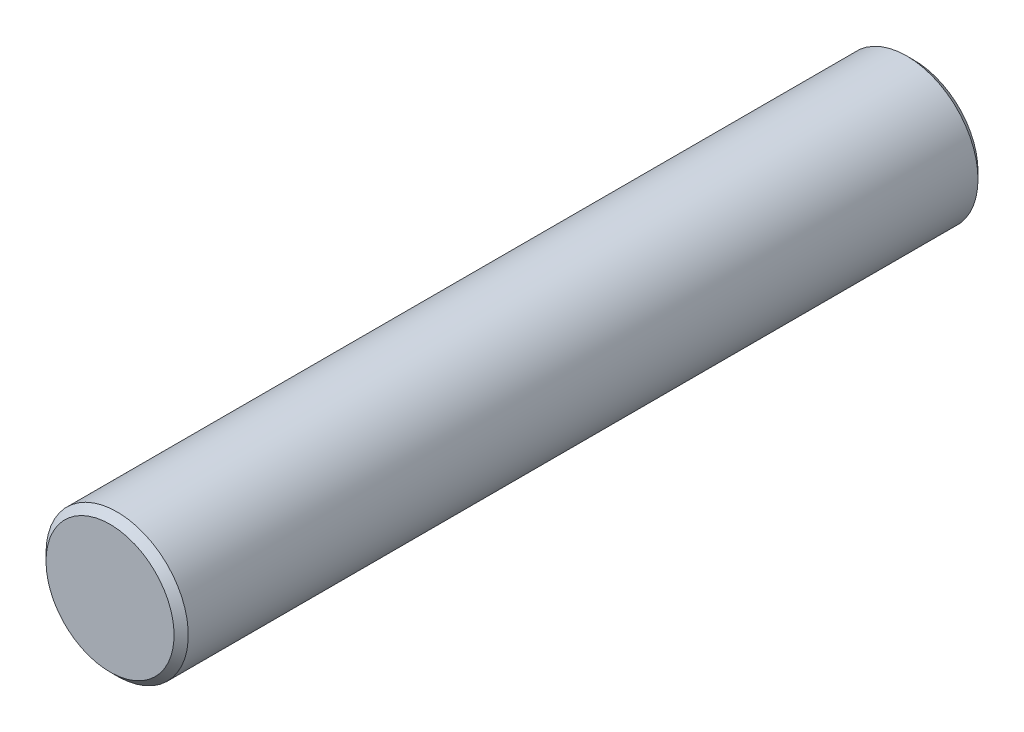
ISO-10303-21;
HEADER;
FILE_DESCRIPTION(('STEP AP214'),'2;1');
FILE_NAME('part.step','',(''),(''),'','','');
FILE_SCHEMA(('AUTOMOTIVE_DESIGN { 1 0 10303 214 1 1 1 1 }'));
ENDSEC;
DATA;
#1=APPLICATION_CONTEXT('core data for automotive mechanical design processes');
#2=APPLICATION_PROTOCOL_DEFINITION('international standard','automotive_design',2000,#1);
#3=PRODUCT_CONTEXT('',#1,'mechanical');
#4=PRODUCT('Part','Part','',(#3));
#5=PRODUCT_RELATED_PRODUCT_CATEGORY('part','',(#4));
#6=PRODUCT_DEFINITION_FORMATION('','',#4);
#7=PRODUCT_DEFINITION_CONTEXT('part definition',#1,'design');
#8=PRODUCT_DEFINITION('design','',#6,#7);
#9=PRODUCT_DEFINITION_SHAPE('','',#8);
#10=(LENGTH_UNIT() NAMED_UNIT(*) SI_UNIT(.MILLI.,.METRE.));
#11=(NAMED_UNIT(*) PLANE_ANGLE_UNIT() SI_UNIT($,.RADIAN.));
#12=(NAMED_UNIT(*) SI_UNIT($,.STERADIAN.) SOLID_ANGLE_UNIT());
#13=UNCERTAINTY_MEASURE_WITH_UNIT(LENGTH_MEASURE(1.E-05),#10,'distance_accuracy_value','');
#14=(GEOMETRIC_REPRESENTATION_CONTEXT(3) GLOBAL_UNCERTAINTY_ASSIGNED_CONTEXT((#13)) GLOBAL_UNIT_ASSIGNED_CONTEXT((#10,
#11,#12)) REPRESENTATION_CONTEXT('',''));
#15=CARTESIAN_POINT('',(0.,0.,0.));
#16=DIRECTION('',(0.,0.,1.));
#17=DIRECTION('',(1.,0.,0.));
#18=AXIS2_PLACEMENT_3D('',#15,#16,#17);
#19=CARTESIAN_POINT('',(0.,-1.66533453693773E-13,113.));
#20=DIRECTION('',(0.,0.,-0.999999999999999));
#21=DIRECTION('',(-0.999999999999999,0.,0.));
#22=AXIS2_PLACEMENT_3D('',#19,#20,#21);
#23=CYLINDRICAL_SURFACE('',#22,10.);
#24=CARTESIAN_POINT('',(0.,0.,1.));
#25=DIRECTION('',(0.,0.,0.999999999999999));
#26=DIRECTION('',(0.999999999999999,0.,0.));
#27=AXIS2_PLACEMENT_3D('',#24,#25,#26);
#28=CIRCLE('',#27,10.);
#29=CARTESIAN_POINT('',(-10.,-1.65423230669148E-13,0.999999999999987));
#30=VERTEX_POINT('',#29);
#31=EDGE_CURVE('E42',#30,#30,#28,.T.);
#32=CARTESIAN_POINT('',(0.,-1.66533453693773E-13,112.));
#33=DIRECTION('',(0.,0.,0.999999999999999));
#34=DIRECTION('',(0.999999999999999,0.,0.));
#35=AXIS2_PLACEMENT_3D('',#32,#33,#34);
#36=CIRCLE('',#35,10.);
#37=CARTESIAN_POINT('',(-10.,-1.65423230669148E-13,112.));
#38=VERTEX_POINT('',#37);
#39=EDGE_CURVE('E46',#38,#38,#36,.F.);
#40=CARTESIAN_POINT('',(-10.,-1.65423230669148E-13,0.999999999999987));
#41=CARTESIAN_POINT('',(-10.,-1.65423230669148E-13,2.15624999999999));
#42=CARTESIAN_POINT('',(-10.,-1.65423230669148E-13,3.31249999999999));
#43=CARTESIAN_POINT('',(-10.,-1.65423230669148E-13,5.62499999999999));
#44=CARTESIAN_POINT('',(-10.,-1.65423230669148E-13,6.78124999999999));
#45=CARTESIAN_POINT('',(-10.,-1.65423230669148E-13,9.09374999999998));
#46=CARTESIAN_POINT('',(-10.,-1.65423230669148E-13,10.25));
#47=CARTESIAN_POINT('',(-10.,-1.65423230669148E-13,12.5625));
#48=CARTESIAN_POINT('',(-10.,-1.65423230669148E-13,13.71875));
#49=CARTESIAN_POINT('',(-10.,-1.65423230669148E-13,16.03125));
#50=CARTESIAN_POINT('',(-10.,-1.65423230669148E-13,17.1875));
#51=CARTESIAN_POINT('',(-10.,-1.65423230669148E-13,19.5));
#52=CARTESIAN_POINT('',(-10.,-1.65423230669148E-13,20.65625));
#53=CARTESIAN_POINT('',(-10.,-1.65423230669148E-13,22.96875));
#54=CARTESIAN_POINT('',(-10.,-1.65423230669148E-13,24.125));
#55=CARTESIAN_POINT('',(-10.,-1.65423230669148E-13,26.4375));
#56=CARTESIAN_POINT('',(-10.,-1.65423230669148E-13,27.59375));
#57=CARTESIAN_POINT('',(-10.,-1.65423230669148E-13,29.90625));
#58=CARTESIAN_POINT('',(-10.,-1.65423230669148E-13,31.0625));
#59=CARTESIAN_POINT('',(-10.,-1.65423230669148E-13,33.375));
#60=CARTESIAN_POINT('',(-10.,-1.65423230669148E-13,34.53125));
#61=CARTESIAN_POINT('',(-10.,-1.65423230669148E-13,36.84375));
#62=CARTESIAN_POINT('',(-10.,-1.65423230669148E-13,38.));
#63=CARTESIAN_POINT('',(-10.,-1.65423230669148E-13,40.3125));
#64=CARTESIAN_POINT('',(-10.,-1.65423230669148E-13,41.46875));
#65=CARTESIAN_POINT('',(-10.,-1.65423230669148E-13,43.78125));
#66=CARTESIAN_POINT('',(-10.,-1.65423230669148E-13,44.9375));
#67=CARTESIAN_POINT('',(-10.,-1.65423230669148E-13,47.25));
#68=CARTESIAN_POINT('',(-10.,-1.65423230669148E-13,48.40625));
#69=CARTESIAN_POINT('',(-10.,-1.65423230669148E-13,50.71875));
#70=CARTESIAN_POINT('',(-10.,-1.65423230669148E-13,51.875));
#71=CARTESIAN_POINT('',(-10.,-1.65423230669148E-13,54.1875));
#72=CARTESIAN_POINT('',(-10.,-1.65423230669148E-13,55.34375));
#73=CARTESIAN_POINT('',(-10.,-1.65423230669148E-13,57.65625));
#74=CARTESIAN_POINT('',(-10.,-1.65423230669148E-13,58.8125));
#75=CARTESIAN_POINT('',(-10.,-1.65423230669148E-13,61.125));
#76=CARTESIAN_POINT('',(-10.,-1.65423230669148E-13,62.28125));
#77=CARTESIAN_POINT('',(-10.,-1.65423230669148E-13,64.59375));
#78=CARTESIAN_POINT('',(-10.,-1.65423230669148E-13,65.75));
#79=CARTESIAN_POINT('',(-10.,-1.65423230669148E-13,68.0625));
#80=CARTESIAN_POINT('',(-10.,-1.65423230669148E-13,69.21875));
#81=CARTESIAN_POINT('',(-10.,-1.65423230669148E-13,71.53125));
#82=CARTESIAN_POINT('',(-10.,-1.65423230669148E-13,72.6875));
#83=CARTESIAN_POINT('',(-10.,-1.65423230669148E-13,75.));
#84=CARTESIAN_POINT('',(-10.,-1.65423230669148E-13,76.15625));
#85=CARTESIAN_POINT('',(-10.,-1.65423230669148E-13,78.46875));
#86=CARTESIAN_POINT('',(-10.,-1.65423230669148E-13,79.625));
#87=CARTESIAN_POINT('',(-10.,-1.65423230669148E-13,81.9375));
#88=CARTESIAN_POINT('',(-10.,-1.65423230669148E-13,83.09375));
#89=CARTESIAN_POINT('',(-10.,-1.65423230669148E-13,85.40625));
#90=CARTESIAN_POINT('',(-10.,-1.65423230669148E-13,86.5625));
#91=CARTESIAN_POINT('',(-10.,-1.65423230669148E-13,88.875));
#92=CARTESIAN_POINT('',(-10.,-1.65423230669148E-13,90.03125));
#93=CARTESIAN_POINT('',(-10.,-1.65423230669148E-13,92.34375));
#94=CARTESIAN_POINT('',(-10.,-1.65423230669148E-13,93.5));
#95=CARTESIAN_POINT('',(-10.,-1.65423230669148E-13,95.8125));
#96=CARTESIAN_POINT('',(-10.,-1.65423230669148E-13,96.96875));
#97=CARTESIAN_POINT('',(-10.,-1.65423230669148E-13,99.28125));
#98=CARTESIAN_POINT('',(-10.,-1.65423230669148E-13,100.4375));
#99=CARTESIAN_POINT('',(-10.,-1.65423230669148E-13,102.75));
#100=CARTESIAN_POINT('',(-10.,-1.65423230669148E-13,103.90625));
#101=CARTESIAN_POINT('',(-10.,-1.65423230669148E-13,106.21875));
#102=CARTESIAN_POINT('',(-10.,-1.65423230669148E-13,107.375));
#103=CARTESIAN_POINT('',(-10.,-1.65423230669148E-13,109.6875));
#104=CARTESIAN_POINT('',(-10.,-1.65423230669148E-13,110.84375));
#105=CARTESIAN_POINT('',(-10.,-1.65423230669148E-13,112.));
#106=B_SPLINE_CURVE_WITH_KNOTS('',3,(#40,#41,#42,#43,#44,#45,#46,#47,#48,#49,#50,#51,#52,#53,
#54,#55,#56,#57,#58,#59,#60,#61,#62,#63,#64,#65,#66,#67,#68,#69,#70,#71,#72,#73,#74,#75,#76,#77,
#78,#79,#80,#81,#82,#83,#84,#85,#86,#87,#88,#89,#90,#91,#92,#93,#94,#95,#96,#97,#98,#99,#100,
#101,#102,#103,#104,#105),.UNSPECIFIED.,.F.,.F.,(4,2,2,2,2,2,2,2,2,2,2,2,2,2,2,2,2,2,2,2,2,2,2,
2,2,2,2,2,2,2,2,2,4),(0.,3.46875000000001,6.9375,10.40625,13.875,17.34375,20.8125,24.28125,
27.75,31.21875,34.6875,38.15625,41.625,45.09375,48.5625,52.03125,55.5,58.96875,62.4375,65.90625,
69.375,72.84375,76.3125,79.78125,83.25,86.71875,90.1875,93.65625,97.125,100.59375,104.0625,
107.53125,111.),.UNSPECIFIED.);
#107=EDGE_CURVE('BSEAM32',#30,#38,#106,.T.);
#108=ORIENTED_EDGE('',*,*,#31,.T.);
#109=ORIENTED_EDGE('',*,*,#39,.T.);
#110=ORIENTED_EDGE('',*,*,#107,.T.);
#111=ORIENTED_EDGE('',*,*,#107,.F.);
#112=EDGE_LOOP('',(#108,#110,#109,#111));
#113=FACE_BOUND('',#112,.T.);
#114=ADVANCED_FACE('F32',(#113),#23,.T.);
#115=CARTESIAN_POINT('',(0.,-1.66533453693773E-13,113.));
#116=DIRECTION('',(0.,0.,0.999999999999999));
#117=DIRECTION('',(0.999999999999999,0.,0.));
#118=AXIS2_PLACEMENT_3D('',#115,#116,#117);
#119=PLANE('',#118);
#120=CARTESIAN_POINT('',(0.,-1.66533453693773E-13,113.));
#121=DIRECTION('',(0.,0.,0.999999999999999));
#122=DIRECTION('',(0.999999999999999,0.,0.));
#123=AXIS2_PLACEMENT_3D('',#120,#121,#122);
#124=CIRCLE('',#123,9.00000000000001);
#125=CARTESIAN_POINT('',(-9.00000000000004,-1.65534252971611E-13,113.));
#126=VERTEX_POINT('',#125);
#127=EDGE_CURVE('E10',#126,#126,#124,.T.);
#128=ORIENTED_EDGE('',*,*,#127,.T.);
#129=EDGE_LOOP('',(#128));
#130=FACE_BOUND('',#129,.T.);
#131=ADVANCED_FACE('F65',(#130),#119,.T.);
#132=CARTESIAN_POINT('',(0.,0.,0.));
#133=DIRECTION('',(0.,0.,0.999999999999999));
#134=DIRECTION('',(0.999999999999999,0.,0.));
#135=AXIS2_PLACEMENT_3D('',#132,#133,#134);
#136=PLANE('',#135);
#137=CARTESIAN_POINT('',(0.,0.,0.));
#138=DIRECTION('',(0.,0.,0.999999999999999));
#139=DIRECTION('',(0.999999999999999,0.,0.));
#140=AXIS2_PLACEMENT_3D('',#137,#138,#139);
#141=CIRCLE('',#140,8.99999999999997);
#142=CARTESIAN_POINT('',(8.99999999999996,0.,0.));
#143=VERTEX_POINT('',#142);
#144=EDGE_CURVE('E38',#143,#143,#141,.F.);
#145=ORIENTED_EDGE('',*,*,#144,.T.);
#146=EDGE_LOOP('',(#145));
#147=FACE_BOUND('',#146,.T.);
#148=ADVANCED_FACE('F61',(#147),#136,.F.);
#149=CARTESIAN_POINT('',(0.,0.,1.));
#150=DIRECTION('',(0.,0.,0.999999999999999));
#151=DIRECTION('',(0.999999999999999,0.,0.));
#152=AXIS2_PLACEMENT_3D('',#149,#150,#151);
#153=CONICAL_SURFACE('',#152,10.,0.785398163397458);
#154=ORIENTED_EDGE('',*,*,#144,.F.);
#155=EDGE_LOOP('',(#154));
#156=FACE_BOUND('',#155,.T.);
#157=ORIENTED_EDGE('',*,*,#31,.F.);
#158=EDGE_LOOP('',(#157));
#159=FACE_BOUND('',#158,.T.);
#160=ADVANCED_FACE('F56',(#156,#159),#153,.T.);
#161=CARTESIAN_POINT('',(0.,-1.66533453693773E-13,113.));
#162=DIRECTION('',(0.,0.,-0.999999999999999));
#163=DIRECTION('',(-0.999999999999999,0.,0.));
#164=AXIS2_PLACEMENT_3D('',#161,#162,#163);
#165=CONICAL_SURFACE('',#164,9.00000000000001,0.785398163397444);
#166=CARTESIAN_POINT('',(-10.,-1.65423230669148E-13,112.));
#167=CARTESIAN_POINT('',(-9.98958333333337,-1.65424387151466E-13,112.010416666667));
#168=CARTESIAN_POINT('',(-9.97916666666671,-1.65425543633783E-13,112.020833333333));
#169=CARTESIAN_POINT('',(-9.95833333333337,-1.65427856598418E-13,112.041666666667));
#170=CARTESIAN_POINT('',(-9.94791666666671,-1.65429013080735E-13,112.052083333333));
#171=CARTESIAN_POINT('',(-9.92708333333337,-1.6543132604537E-13,112.072916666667));
#172=CARTESIAN_POINT('',(-9.91666666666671,-1.65432482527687E-13,112.083333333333));
#173=CARTESIAN_POINT('',(-9.89583333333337,-1.65434795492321E-13,112.104166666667));
#174=CARTESIAN_POINT('',(-9.8854166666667,-1.65435951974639E-13,112.114583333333));
#175=CARTESIAN_POINT('',(-9.86458333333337,-1.65438264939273E-13,112.135416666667));
#176=CARTESIAN_POINT('',(-9.85416666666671,-1.65439421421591E-13,112.145833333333));
#177=CARTESIAN_POINT('',(-9.83333333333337,-1.65441734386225E-13,112.166666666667));
#178=CARTESIAN_POINT('',(-9.82291666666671,-1.65442890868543E-13,112.177083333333));
#179=CARTESIAN_POINT('',(-9.80208333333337,-1.65445203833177E-13,112.197916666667));
#180=CARTESIAN_POINT('',(-9.79166666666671,-1.65446360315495E-13,112.208333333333));
#181=CARTESIAN_POINT('',(-9.77083333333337,-1.65448673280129E-13,112.229166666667));
#182=CARTESIAN_POINT('',(-9.76041666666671,-1.65449829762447E-13,112.239583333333));
#183=CARTESIAN_POINT('',(-9.73958333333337,-1.65452142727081E-13,112.260416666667));
#184=CARTESIAN_POINT('',(-9.72916666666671,-1.65453299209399E-13,112.270833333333));
#185=CARTESIAN_POINT('',(-9.70833333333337,-1.65455612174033E-13,112.291666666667));
#186=CARTESIAN_POINT('',(-9.69791666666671,-1.65456768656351E-13,112.302083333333));
#187=CARTESIAN_POINT('',(-9.67708333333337,-1.65459081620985E-13,112.322916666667));
#188=CARTESIAN_POINT('',(-9.66666666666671,-1.65460238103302E-13,112.333333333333));
#189=CARTESIAN_POINT('',(-9.64583333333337,-1.65462551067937E-13,112.354166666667));
#190=CARTESIAN_POINT('',(-9.63541666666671,-1.65463707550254E-13,112.364583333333));
#191=CARTESIAN_POINT('',(-9.61458333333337,-1.65466020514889E-13,112.385416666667));
#192=CARTESIAN_POINT('',(-9.60416666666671,-1.65467176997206E-13,112.395833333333));
#193=CARTESIAN_POINT('',(-9.58333333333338,-1.65469489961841E-13,112.416666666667));
#194=CARTESIAN_POINT('',(-9.57291666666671,-1.65470646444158E-13,112.427083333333));
#195=CARTESIAN_POINT('',(-9.55208333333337,-1.65472959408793E-13,112.447916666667));
#196=CARTESIAN_POINT('',(-9.54166666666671,-1.6547411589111E-13,112.458333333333));
#197=CARTESIAN_POINT('',(-9.52083333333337,-1.65476428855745E-13,112.479166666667));
#198=CARTESIAN_POINT('',(-9.51041666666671,-1.65477585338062E-13,112.489583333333));
#199=CARTESIAN_POINT('',(-9.48958333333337,-1.65479898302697E-13,112.510416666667));
#200=CARTESIAN_POINT('',(-9.47916666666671,-1.65481054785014E-13,112.520833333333));
#201=CARTESIAN_POINT('',(-9.45833333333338,-1.65483367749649E-13,112.541666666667));
#202=CARTESIAN_POINT('',(-9.44791666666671,-1.65484524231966E-13,112.552083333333));
#203=CARTESIAN_POINT('',(-9.42708333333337,-1.65486837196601E-13,112.572916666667));
#204=CARTESIAN_POINT('',(-9.41666666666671,-1.65487993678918E-13,112.583333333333));
#205=CARTESIAN_POINT('',(-9.39583333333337,-1.65490306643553E-13,112.604166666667));
#206=CARTESIAN_POINT('',(-9.38541666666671,-1.6549146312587E-13,112.614583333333));
#207=CARTESIAN_POINT('',(-9.36458333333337,-1.65493776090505E-13,112.635416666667));
#208=CARTESIAN_POINT('',(-9.35416666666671,-1.65494932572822E-13,112.645833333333));
#209=CARTESIAN_POINT('',(-9.33333333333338,-1.65497245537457E-13,112.666666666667));
#210=CARTESIAN_POINT('',(-9.32291666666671,-1.65498402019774E-13,112.677083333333));
#211=CARTESIAN_POINT('',(-9.30208333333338,-1.65500714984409E-13,112.697916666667));
#212=CARTESIAN_POINT('',(-9.29166666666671,-1.65501871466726E-13,112.708333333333));
#213=CARTESIAN_POINT('',(-9.27083333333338,-1.65504184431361E-13,112.729166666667));
#214=CARTESIAN_POINT('',(-9.26041666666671,-1.65505340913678E-13,112.739583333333));
#215=CARTESIAN_POINT('',(-9.23958333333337,-1.65507653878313E-13,112.760416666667));
#216=CARTESIAN_POINT('',(-9.22916666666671,-1.6550881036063E-13,112.770833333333));
#217=CARTESIAN_POINT('',(-9.20833333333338,-1.65511123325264E-13,112.791666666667));
#218=CARTESIAN_POINT('',(-9.19791666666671,-1.65512279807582E-13,112.802083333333));
#219=CARTESIAN_POINT('',(-9.17708333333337,-1.65514592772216E-13,112.822916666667));
#220=CARTESIAN_POINT('',(-9.16666666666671,-1.65515749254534E-13,112.833333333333));
#221=CARTESIAN_POINT('',(-9.14583333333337,-1.65518062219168E-13,112.854166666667));
#222=CARTESIAN_POINT('',(-9.13541666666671,-1.65519218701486E-13,112.864583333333));
#223=CARTESIAN_POINT('',(-9.11458333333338,-1.6552153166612E-13,112.885416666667));
#224=CARTESIAN_POINT('',(-9.10416666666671,-1.65522688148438E-13,112.895833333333));
#225=CARTESIAN_POINT('',(-9.08333333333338,-1.65525001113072E-13,112.916666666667));
#226=CARTESIAN_POINT('',(-9.07291666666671,-1.6552615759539E-13,112.927083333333));
#227=CARTESIAN_POINT('',(-9.05208333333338,-1.65528470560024E-13,112.947916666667));
#228=CARTESIAN_POINT('',(-9.04166666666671,-1.65529627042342E-13,112.958333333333));
#229=CARTESIAN_POINT('',(-9.02083333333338,-1.65531940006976E-13,112.979166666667));
#230=CARTESIAN_POINT('',(-9.01041666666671,-1.65533096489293E-13,112.989583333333));
#231=CARTESIAN_POINT('',(-9.00000000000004,-1.65534252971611E-13,113.));
#232=B_SPLINE_CURVE_WITH_KNOTS('',3,(#166,#167,#168,#169,#170,#171,#172,#173,#174,#175,#176,
#177,#178,#179,#180,#181,#182,#183,#184,#185,#186,#187,#188,#189,#190,#191,#192,#193,#194,#195,
#196,#197,#198,#199,#200,#201,#202,#203,#204,#205,#206,#207,#208,#209,#210,#211,#212,#213,#214,
#215,#216,#217,#218,#219,#220,#221,#222,#223,#224,#225,#226,#227,#228,#229,#230,#231),
.UNSPECIFIED.,.F.,.F.,(4,2,2,2,2,2,2,2,2,2,2,2,2,2,2,2,2,2,2,2,2,2,2,2,2,2,2,2,2,2,2,2,4),(0.,
0.0441941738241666,0.0883883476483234,0.13258252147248,0.176776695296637,0.220970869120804,
0.265165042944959,0.309359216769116,0.353553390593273,0.397747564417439,0.441941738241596,
0.486135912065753,0.53033008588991,0.574524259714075,0.618718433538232,0.662912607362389,
0.707106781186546,0.751300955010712,0.795495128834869,0.839689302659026,0.883883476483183,
0.928077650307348,0.972271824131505,1.01646599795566,1.06066017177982,1.10485434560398,
1.14904851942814,1.1932426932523,1.23743686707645,1.28163104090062,1.32582521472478,
1.37001938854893,1.4142135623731),.UNSPECIFIED.);
#233=EDGE_CURVE('BSEAM53',#38,#126,#232,.T.);
#234=ORIENTED_EDGE('',*,*,#39,.F.);
#235=ORIENTED_EDGE('',*,*,#127,.F.);
#236=ORIENTED_EDGE('',*,*,#233,.T.);
#237=ORIENTED_EDGE('',*,*,#233,.F.);
#238=EDGE_LOOP('',(#234,#236,#235,#237));
#239=FACE_BOUND('',#238,.T.);
#240=ADVANCED_FACE('F53',(#239),#165,.T.);
#241=CLOSED_SHELL('',(#114,#131,#148,#160,#240));
#242=MANIFOLD_SOLID_BREP('B2',#241);
#243=ADVANCED_BREP_SHAPE_REPRESENTATION('',(#18,#242),#14);
#244=SHAPE_DEFINITION_REPRESENTATION(#9,#243);
ENDSEC;
END-ISO-10303-21;
